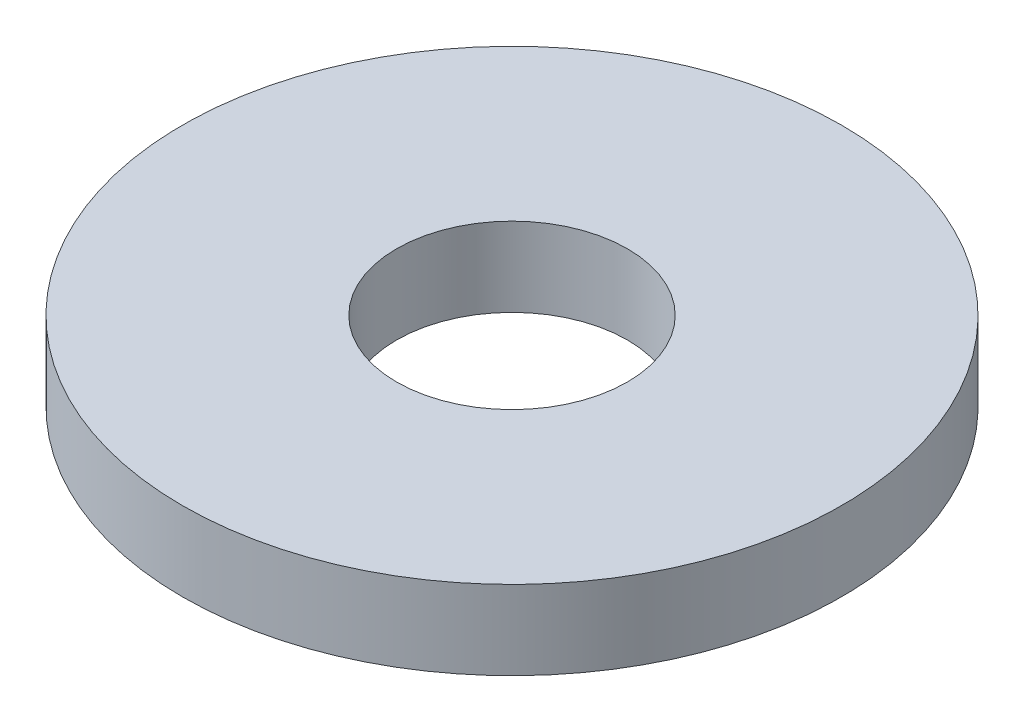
ISO-10303-21;
HEADER;
FILE_DESCRIPTION(('STEP AP214'),'2;1');
FILE_NAME('part.step','',(''),(''),'','','');
FILE_SCHEMA(('AUTOMOTIVE_DESIGN { 1 0 10303 214 1 1 1 1 }'));
ENDSEC;
DATA;
#1=APPLICATION_CONTEXT('core data for automotive mechanical design processes');
#2=APPLICATION_PROTOCOL_DEFINITION('international standard','automotive_design',2000,#1);
#3=PRODUCT_CONTEXT('',#1,'mechanical');
#4=PRODUCT('Part','Part','',(#3));
#5=PRODUCT_RELATED_PRODUCT_CATEGORY('part','',(#4));
#6=PRODUCT_DEFINITION_FORMATION('','',#4);
#7=PRODUCT_DEFINITION_CONTEXT('part definition',#1,'design');
#8=PRODUCT_DEFINITION('design','',#6,#7);
#9=PRODUCT_DEFINITION_SHAPE('','',#8);
#10=(LENGTH_UNIT() NAMED_UNIT(*) SI_UNIT(.MILLI.,.METRE.));
#11=(NAMED_UNIT(*) PLANE_ANGLE_UNIT() SI_UNIT($,.RADIAN.));
#12=(NAMED_UNIT(*) SI_UNIT($,.STERADIAN.) SOLID_ANGLE_UNIT());
#13=UNCERTAINTY_MEASURE_WITH_UNIT(LENGTH_MEASURE(1.E-05),#10,'distance_accuracy_value','');
#14=(GEOMETRIC_REPRESENTATION_CONTEXT(3) GLOBAL_UNCERTAINTY_ASSIGNED_CONTEXT((#13)) GLOBAL_UNIT_ASSIGNED_CONTEXT((#10,
#11,#12)) REPRESENTATION_CONTEXT('',''));
#15=CARTESIAN_POINT('',(0.,0.,0.));
#16=DIRECTION('',(0.,0.,1.));
#17=DIRECTION('',(1.,0.,0.));
#18=AXIS2_PLACEMENT_3D('',#15,#16,#17);
#19=CARTESIAN_POINT('',(0.,1.2,0.));
#20=DIRECTION('',(0.,1.,0.));
#21=DIRECTION('',(0.,0.,1.));
#22=AXIS2_PLACEMENT_3D('',#19,#20,#21);
#23=PLANE('',#22);
#24=CARTESIAN_POINT('',(0.,1.2,0.));
#25=DIRECTION('',(0.,1.,0.));
#26=DIRECTION('',(0.,0.,1.));
#27=AXIS2_PLACEMENT_3D('',#24,#25,#26);
#28=CIRCLE('',#27,5.0038);
#29=CARTESIAN_POINT('',(0.,1.2,5.0038));
#30=VERTEX_POINT('',#29);
#31=EDGE_CURVE('E10',#30,#30,#28,.T.);
#32=ORIENTED_EDGE('',*,*,#31,.T.);
#33=EDGE_LOOP('',(#32));
#34=FACE_BOUND('',#33,.T.);
#35=CARTESIAN_POINT('',(0.,1.2,0.));
#36=DIRECTION('',(0.,1.,0.));
#37=DIRECTION('',(0.,0.,1.));
#38=AXIS2_PLACEMENT_3D('',#35,#36,#37);
#39=CIRCLE('',#38,1.7526);
#40=CARTESIAN_POINT('',(0.,1.2,1.7526));
#41=VERTEX_POINT('',#40);
#42=EDGE_CURVE('E44',#41,#41,#39,.T.);
#43=ORIENTED_EDGE('',*,*,#42,.F.);
#44=EDGE_LOOP('',(#43));
#45=FACE_BOUND('',#44,.T.);
#46=ADVANCED_FACE('F33',(#34,#45),#23,.T.);
#47=CARTESIAN_POINT('',(0.,0.,0.));
#48=DIRECTION('',(0.,1.,0.));
#49=DIRECTION('',(0.,0.,1.));
#50=AXIS2_PLACEMENT_3D('',#47,#48,#49);
#51=PLANE('',#50);
#52=CARTESIAN_POINT('',(0.,0.,0.));
#53=DIRECTION('',(0.,1.,0.));
#54=DIRECTION('',(0.,0.,1.));
#55=AXIS2_PLACEMENT_3D('',#52,#53,#54);
#56=CIRCLE('',#55,5.0038);
#57=CARTESIAN_POINT('',(0.,0.,5.0038));
#58=VERTEX_POINT('',#57);
#59=EDGE_CURVE('E37',#58,#58,#56,.T.);
#60=ORIENTED_EDGE('',*,*,#59,.F.);
#61=EDGE_LOOP('',(#60));
#62=FACE_BOUND('',#61,.T.);
#63=CARTESIAN_POINT('',(0.,0.,0.));
#64=DIRECTION('',(0.,1.,0.));
#65=DIRECTION('',(0.,0.,1.));
#66=AXIS2_PLACEMENT_3D('',#63,#64,#65);
#67=CIRCLE('',#66,1.7526);
#68=CARTESIAN_POINT('',(0.,0.,1.7526));
#69=VERTEX_POINT('',#68);
#70=EDGE_CURVE('E46',#69,#69,#67,.T.);
#71=ORIENTED_EDGE('',*,*,#70,.T.);
#72=EDGE_LOOP('',(#71));
#73=FACE_BOUND('',#72,.T.);
#74=ADVANCED_FACE('F56',(#62,#73),#51,.F.);
#75=CARTESIAN_POINT('',(0.,1.2,0.));
#76=DIRECTION('',(0.,-1.,0.));
#77=DIRECTION('',(0.,0.,-1.));
#78=AXIS2_PLACEMENT_3D('',#75,#76,#77);
#79=CYLINDRICAL_SURFACE('',#78,5.0038);
#80=ORIENTED_EDGE('',*,*,#31,.F.);
#81=EDGE_LOOP('',(#80));
#82=FACE_BOUND('',#81,.T.);
#83=ORIENTED_EDGE('',*,*,#59,.T.);
#84=EDGE_LOOP('',(#83));
#85=FACE_BOUND('',#84,.T.);
#86=ADVANCED_FACE('F35',(#82,#85),#79,.T.);
#87=CARTESIAN_POINT('',(0.,1.2,0.));
#88=DIRECTION('',(0.,-1.,0.));
#89=DIRECTION('',(0.,0.,-1.));
#90=AXIS2_PLACEMENT_3D('',#87,#88,#89);
#91=CYLINDRICAL_SURFACE('',#90,1.7526);
#92=ORIENTED_EDGE('',*,*,#42,.T.);
#93=EDGE_LOOP('',(#92));
#94=FACE_BOUND('',#93,.T.);
#95=ORIENTED_EDGE('',*,*,#70,.F.);
#96=EDGE_LOOP('',(#95));
#97=FACE_BOUND('',#96,.T.);
#98=ADVANCED_FACE('F52',(#94,#97),#91,.F.);
#99=CLOSED_SHELL('',(#46,#74,#86,#98));
#100=MANIFOLD_SOLID_BREP('B2',#99);
#101=ADVANCED_BREP_SHAPE_REPRESENTATION('',(#18,#100),#14);
#102=SHAPE_DEFINITION_REPRESENTATION(#9,#101);
ENDSEC;
END-ISO-10303-21;
